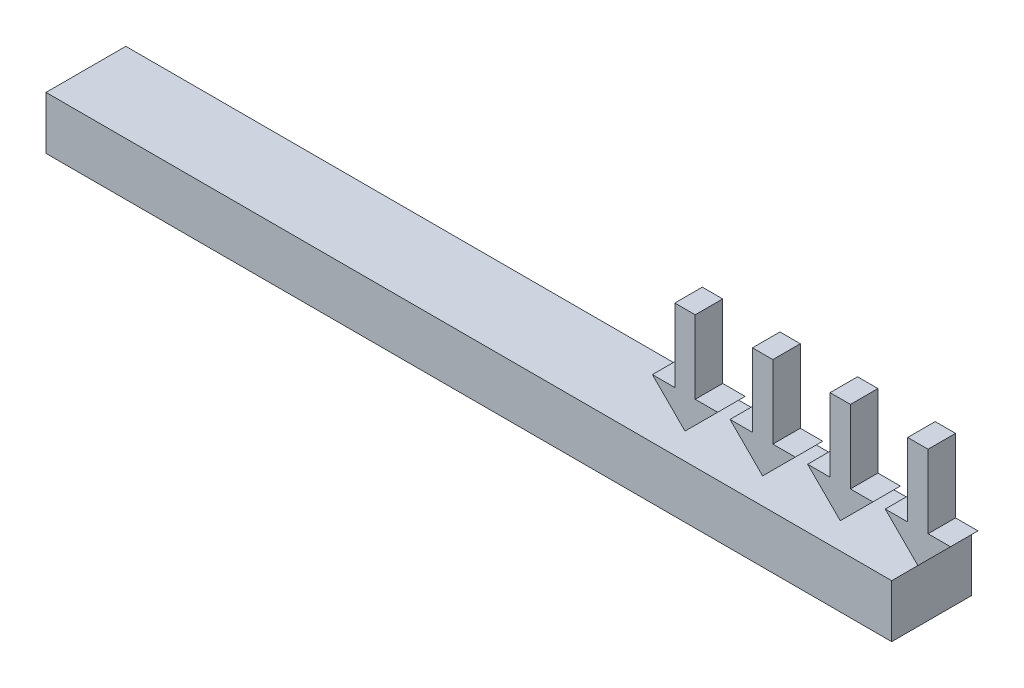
ISO-10303-21;
HEADER;
FILE_DESCRIPTION(('STEP AP214'),'2;1');
FILE_NAME('part.step','',(''),(''),'','','');
FILE_SCHEMA(('AUTOMOTIVE_DESIGN { 1 0 10303 214 1 1 1 1 }'));
ENDSEC;
DATA;
#1=APPLICATION_CONTEXT('core data for automotive mechanical design processes');
#2=APPLICATION_PROTOCOL_DEFINITION('international standard','automotive_design',2000,#1);
#3=PRODUCT_CONTEXT('',#1,'mechanical');
#4=PRODUCT('Part','Part','',(#3));
#5=PRODUCT_RELATED_PRODUCT_CATEGORY('part','',(#4));
#6=PRODUCT_DEFINITION_FORMATION('','',#4);
#7=PRODUCT_DEFINITION_CONTEXT('part definition',#1,'design');
#8=PRODUCT_DEFINITION('design','',#6,#7);
#9=PRODUCT_DEFINITION_SHAPE('','',#8);
#10=(LENGTH_UNIT() NAMED_UNIT(*) SI_UNIT(.MILLI.,.METRE.));
#11=(NAMED_UNIT(*) PLANE_ANGLE_UNIT() SI_UNIT($,.RADIAN.));
#12=(NAMED_UNIT(*) SI_UNIT($,.STERADIAN.) SOLID_ANGLE_UNIT());
#13=UNCERTAINTY_MEASURE_WITH_UNIT(LENGTH_MEASURE(1.E-05),#10,'distance_accuracy_value','');
#14=(GEOMETRIC_REPRESENTATION_CONTEXT(3) GLOBAL_UNCERTAINTY_ASSIGNED_CONTEXT((#13)) GLOBAL_UNIT_ASSIGNED_CONTEXT((#10,
#11,#12)) REPRESENTATION_CONTEXT('',''));
#15=CARTESIAN_POINT('',(0.,0.,0.));
#16=DIRECTION('',(0.,0.,1.));
#17=DIRECTION('',(1.,0.,0.));
#18=AXIS2_PLACEMENT_3D('',#15,#16,#17);
#19=CARTESIAN_POINT('',(289.602018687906,76.2654378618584,6.604));
#20=DIRECTION('',(1.,0.,0.));
#21=DIRECTION('',(0.,0.,-1.));
#22=AXIS2_PLACEMENT_3D('',#19,#20,#21);
#23=PLANE('',#22);
#24=DIRECTION('',(0.,-1.,0.));
#25=VECTOR('',#24,1.);
#26=CARTESIAN_POINT('',(289.602018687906,76.2654378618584,-6.604));
#27=LINE('',#26,#25);
#28=CARTESIAN_POINT('',(289.602018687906,76.2654378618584,-6.604));
#29=VERTEX_POINT('',#28);
#30=CARTESIAN_POINT('',(289.602018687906,41.0825470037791,-6.604));
#31=VERTEX_POINT('',#30);
#32=EDGE_CURVE('E132',#29,#31,#27,.T.);
#33=ORIENTED_EDGE('',*,*,#32,.T.);
#34=DIRECTION('',(0.,0.,-1.));
#35=VECTOR('',#34,1.);
#36=CARTESIAN_POINT('',(289.602018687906,41.0825470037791,6.604));
#37=LINE('',#36,#35);
#38=CARTESIAN_POINT('',(289.602018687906,41.0825470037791,6.604));
#39=VERTEX_POINT('',#38);
#40=EDGE_CURVE('E12',#39,#31,#37,.T.);
#41=ORIENTED_EDGE('',*,*,#40,.F.);
#42=DIRECTION('',(0.,-1.,0.));
#43=VECTOR('',#42,1.);
#44=CARTESIAN_POINT('',(289.602018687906,76.2654378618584,6.604));
#45=LINE('',#44,#43);
#46=CARTESIAN_POINT('',(289.602018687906,76.2654378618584,6.604));
#47=VERTEX_POINT('',#46);
#48=EDGE_CURVE('E144',#47,#39,#45,.T.);
#49=ORIENTED_EDGE('',*,*,#48,.F.);
#50=DIRECTION('',(0.,0.,-1.));
#51=VECTOR('',#50,1.);
#52=CARTESIAN_POINT('',(289.602018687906,76.2654378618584,6.604));
#53=LINE('',#52,#51);
#54=EDGE_CURVE('E128',#47,#29,#53,.T.);
#55=ORIENTED_EDGE('',*,*,#54,.T.);
#56=EDGE_LOOP('',(#33,#41,#49,#55));
#57=FACE_BOUND('',#56,.T.);
#58=ADVANCED_FACE('F42',(#57),#23,.F.);
#59=CARTESIAN_POINT('',(289.602018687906,41.0825470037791,6.604));
#60=DIRECTION('',(0.,-1.,0.));
#61=DIRECTION('',(0.,0.,-1.));
#62=AXIS2_PLACEMENT_3D('',#59,#60,#61);
#63=PLANE('',#62);
#64=DIRECTION('',(-1.,0.,0.));
#65=VECTOR('',#64,1.);
#66=CARTESIAN_POINT('',(289.602018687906,41.0825470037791,-6.604));
#67=LINE('',#66,#65);
#68=CARTESIAN_POINT('',(278.817452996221,41.0825470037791,-6.604));
#69=VERTEX_POINT('',#68);
#70=EDGE_CURVE('E135',#31,#69,#67,.T.);
#71=ORIENTED_EDGE('',*,*,#70,.T.);
#72=DIRECTION('',(0.,0.,-1.));
#73=VECTOR('',#72,1.);
#74=CARTESIAN_POINT('',(278.817452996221,41.0825470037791,6.604));
#75=LINE('',#74,#73);
#76=CARTESIAN_POINT('',(278.817452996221,41.0825470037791,6.604));
#77=VERTEX_POINT('',#76);
#78=EDGE_CURVE('E50',#77,#69,#75,.T.);
#79=ORIENTED_EDGE('',*,*,#78,.F.);
#80=DIRECTION('',(-1.,0.,0.));
#81=VECTOR('',#80,1.);
#82=CARTESIAN_POINT('',(289.602018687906,41.0825470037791,6.604));
#83=LINE('',#82,#81);
#84=EDGE_CURVE('E98',#39,#77,#83,.T.);
#85=ORIENTED_EDGE('',*,*,#84,.F.);
#86=ORIENTED_EDGE('',*,*,#40,.T.);
#87=EDGE_LOOP('',(#71,#79,#85,#86));
#88=FACE_BOUND('',#87,.T.);
#89=ADVANCED_FACE('F169',(#88),#63,.F.);
#90=CARTESIAN_POINT('',(278.817452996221,41.0825470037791,6.604));
#91=DIRECTION('',(0.707106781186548,0.707106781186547,0.));
#92=DIRECTION('',(-0.707106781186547,0.707106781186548,0.));
#93=AXIS2_PLACEMENT_3D('',#90,#91,#92);
#94=PLANE('',#93);
#95=DIRECTION('',(0.707106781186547,-0.707106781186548,0.));
#96=VECTOR('',#95,1.);
#97=CARTESIAN_POINT('',(278.817452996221,41.0825470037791,-6.604));
#98=LINE('',#97,#96);
#99=CARTESIAN_POINT('',(294.5,25.4,-6.604));
#100=VERTEX_POINT('',#99);
#101=EDGE_CURVE('E137',#69,#100,#98,.T.);
#102=ORIENTED_EDGE('',*,*,#101,.T.);
#103=DIRECTION('',(0.,0.,-1.));
#104=VECTOR('',#103,1.);
#105=CARTESIAN_POINT('',(294.5,25.4,6.604));
#106=LINE('',#105,#104);
#107=CARTESIAN_POINT('',(294.5,25.4,6.604));
#108=VERTEX_POINT('',#107);
#109=EDGE_CURVE('E148',#108,#100,#106,.T.);
#110=ORIENTED_EDGE('',*,*,#109,.F.);
#111=DIRECTION('',(0.707106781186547,-0.707106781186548,0.));
#112=VECTOR('',#111,1.);
#113=CARTESIAN_POINT('',(278.817452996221,41.0825470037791,6.604));
#114=LINE('',#113,#112);
#115=EDGE_CURVE('E156',#77,#108,#114,.T.);
#116=ORIENTED_EDGE('',*,*,#115,.F.);
#117=ORIENTED_EDGE('',*,*,#78,.T.);
#118=EDGE_LOOP('',(#102,#110,#116,#117));
#119=FACE_BOUND('',#118,.T.);
#120=ADVANCED_FACE('F154',(#119),#94,.F.);
#121=CARTESIAN_POINT('',(294.5,25.4,6.604));
#122=DIRECTION('',(-0.707106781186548,0.707106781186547,0.));
#123=DIRECTION('',(-0.707106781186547,-0.707106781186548,0.));
#124=AXIS2_PLACEMENT_3D('',#121,#122,#123);
#125=PLANE('',#124);
#126=DIRECTION('',(0.707106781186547,0.707106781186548,0.));
#127=VECTOR('',#126,1.);
#128=CARTESIAN_POINT('',(294.5,25.4,-6.604));
#129=LINE('',#128,#127);
#130=CARTESIAN_POINT('',(310.182547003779,41.0825470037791,-6.604));
#131=VERTEX_POINT('',#130);
#132=EDGE_CURVE('E139',#100,#131,#129,.T.);
#133=ORIENTED_EDGE('',*,*,#132,.T.);
#134=DIRECTION('',(0.,0.,-1.));
#135=VECTOR('',#134,1.);
#136=CARTESIAN_POINT('',(310.182547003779,41.0825470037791,6.604));
#137=LINE('',#136,#135);
#138=CARTESIAN_POINT('',(310.182547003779,41.0825470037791,6.604));
#139=VERTEX_POINT('',#138);
#140=EDGE_CURVE('E123',#139,#131,#137,.T.);
#141=ORIENTED_EDGE('',*,*,#140,.F.);
#142=DIRECTION('',(0.707106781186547,0.707106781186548,0.));
#143=VECTOR('',#142,1.);
#144=CARTESIAN_POINT('',(294.5,25.4,6.604));
#145=LINE('',#144,#143);
#146=EDGE_CURVE('E114',#108,#139,#145,.T.);
#147=ORIENTED_EDGE('',*,*,#146,.F.);
#148=ORIENTED_EDGE('',*,*,#109,.T.);
#149=EDGE_LOOP('',(#133,#141,#147,#148));
#150=FACE_BOUND('',#149,.T.);
#151=ADVANCED_FACE('F162',(#150),#125,.F.);
#152=CARTESIAN_POINT('',(310.182547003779,41.0825470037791,6.604));
#153=DIRECTION('',(0.,-1.,0.));
#154=DIRECTION('',(0.,0.,-1.));
#155=AXIS2_PLACEMENT_3D('',#152,#153,#154);
#156=PLANE('',#155);
#157=DIRECTION('',(-1.,0.,0.));
#158=VECTOR('',#157,1.);
#159=CARTESIAN_POINT('',(310.182547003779,41.0825470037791,-6.604));
#160=LINE('',#159,#158);
#161=CARTESIAN_POINT('',(299.397981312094,41.0825470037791,-6.604));
#162=VERTEX_POINT('',#161);
#163=EDGE_CURVE('E122',#131,#162,#160,.T.);
#164=ORIENTED_EDGE('',*,*,#163,.T.);
#165=DIRECTION('',(0.,0.,-1.));
#166=VECTOR('',#165,1.);
#167=CARTESIAN_POINT('',(299.397981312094,41.0825470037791,6.604));
#168=LINE('',#167,#166);
#169=CARTESIAN_POINT('',(299.397981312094,41.0825470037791,6.604));
#170=VERTEX_POINT('',#169);
#171=EDGE_CURVE('E119',#170,#162,#168,.T.);
#172=ORIENTED_EDGE('',*,*,#171,.F.);
#173=DIRECTION('',(-1.,0.,0.));
#174=VECTOR('',#173,1.);
#175=CARTESIAN_POINT('',(310.182547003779,41.0825470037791,6.604));
#176=LINE('',#175,#174);
#177=EDGE_CURVE('E108',#139,#170,#176,.T.);
#178=ORIENTED_EDGE('',*,*,#177,.F.);
#179=ORIENTED_EDGE('',*,*,#140,.T.);
#180=EDGE_LOOP('',(#164,#172,#178,#179));
#181=FACE_BOUND('',#180,.T.);
#182=ADVANCED_FACE('F120',(#181),#156,.F.);
#183=CARTESIAN_POINT('',(299.397981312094,76.2654378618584,6.604));
#184=DIRECTION('',(-1.,0.,0.));
#185=DIRECTION('',(0.,0.,1.));
#186=AXIS2_PLACEMENT_3D('',#183,#184,#185);
#187=PLANE('',#186);
#188=DIRECTION('',(0.,1.,0.));
#189=VECTOR('',#188,1.);
#190=CARTESIAN_POINT('',(299.397981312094,76.2654378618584,-6.604));
#191=LINE('',#190,#189);
#192=CARTESIAN_POINT('',(299.397981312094,76.2654378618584,-6.604));
#193=VERTEX_POINT('',#192);
#194=EDGE_CURVE('E84',#162,#193,#191,.T.);
#195=ORIENTED_EDGE('',*,*,#194,.T.);
#196=DIRECTION('',(0.,0.,-1.));
#197=VECTOR('',#196,1.);
#198=CARTESIAN_POINT('',(299.397981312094,76.2654378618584,6.604));
#199=LINE('',#198,#197);
#200=CARTESIAN_POINT('',(299.397981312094,76.2654378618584,6.604));
#201=VERTEX_POINT('',#200);
#202=EDGE_CURVE('E124',#201,#193,#199,.T.);
#203=ORIENTED_EDGE('',*,*,#202,.F.);
#204=DIRECTION('',(0.,1.,0.));
#205=VECTOR('',#204,1.);
#206=CARTESIAN_POINT('',(299.397981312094,76.2654378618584,6.604));
#207=LINE('',#206,#205);
#208=EDGE_CURVE('E112',#170,#201,#207,.T.);
#209=ORIENTED_EDGE('',*,*,#208,.F.);
#210=ORIENTED_EDGE('',*,*,#171,.T.);
#211=EDGE_LOOP('',(#195,#203,#209,#210));
#212=FACE_BOUND('',#211,.T.);
#213=ADVANCED_FACE('F126',(#212),#187,.F.);
#214=CARTESIAN_POINT('',(289.602018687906,76.2654378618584,6.604));
#215=DIRECTION('',(0.,-1.,0.));
#216=DIRECTION('',(0.,0.,-1.));
#217=AXIS2_PLACEMENT_3D('',#214,#215,#216);
#218=PLANE('',#217);
#219=DIRECTION('',(-1.,0.,0.));
#220=VECTOR('',#219,1.);
#221=CARTESIAN_POINT('',(289.602018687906,76.2654378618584,-6.604));
#222=LINE('',#221,#220);
#223=EDGE_CURVE('E90',#193,#29,#222,.T.);
#224=ORIENTED_EDGE('',*,*,#223,.T.);
#225=ORIENTED_EDGE('',*,*,#54,.F.);
#226=DIRECTION('',(-1.,0.,0.));
#227=VECTOR('',#226,1.);
#228=CARTESIAN_POINT('',(289.602018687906,76.2654378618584,6.604));
#229=LINE('',#228,#227);
#230=EDGE_CURVE('E58',#201,#47,#229,.T.);
#231=ORIENTED_EDGE('',*,*,#230,.F.);
#232=ORIENTED_EDGE('',*,*,#202,.T.);
#233=EDGE_LOOP('',(#224,#225,#231,#232));
#234=FACE_BOUND('',#233,.T.);
#235=ADVANCED_FACE('F183',(#234),#218,.F.);
#236=CARTESIAN_POINT('',(289.602018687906,41.0825470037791,6.604));
#237=DIRECTION('',(0.,0.,-1.));
#238=DIRECTION('',(-1.,0.,0.));
#239=AXIS2_PLACEMENT_3D('',#236,#237,#238);
#240=PLANE('',#239);
#241=ORIENTED_EDGE('',*,*,#48,.T.);
#242=ORIENTED_EDGE('',*,*,#84,.T.);
#243=ORIENTED_EDGE('',*,*,#115,.T.);
#244=ORIENTED_EDGE('',*,*,#146,.T.);
#245=ORIENTED_EDGE('',*,*,#177,.T.);
#246=ORIENTED_EDGE('',*,*,#208,.T.);
#247=ORIENTED_EDGE('',*,*,#230,.T.);
#248=EDGE_LOOP('',(#241,#242,#243,#244,#245,#246,#247));
#249=FACE_BOUND('',#248,.T.);
#250=ADVANCED_FACE('F110',(#249),#240,.F.);
#251=CARTESIAN_POINT('',(289.602018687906,41.0825470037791,-6.604));
#252=DIRECTION('',(0.,0.,-1.));
#253=DIRECTION('',(-1.,0.,0.));
#254=AXIS2_PLACEMENT_3D('',#251,#252,#253);
#255=PLANE('',#254);
#256=ORIENTED_EDGE('',*,*,#32,.F.);
#257=ORIENTED_EDGE('',*,*,#223,.F.);
#258=ORIENTED_EDGE('',*,*,#194,.F.);
#259=ORIENTED_EDGE('',*,*,#163,.F.);
#260=ORIENTED_EDGE('',*,*,#132,.F.);
#261=ORIENTED_EDGE('',*,*,#101,.F.);
#262=ORIENTED_EDGE('',*,*,#70,.F.);
#263=EDGE_LOOP('',(#256,#257,#258,#259,#260,#261,#262));
#264=FACE_BOUND('',#263,.T.);
#265=ADVANCED_FACE('F160',(#264),#255,.T.);
#266=CLOSED_SHELL('',(#58,#89,#120,#151,#182,#213,#235,#250,#265));
#267=MANIFOLD_SOLID_BREP('B2',#266);
#268=CARTESIAN_POINT('',(326.902018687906,76.2654378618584,6.604));
#269=DIRECTION('',(1.,0.,0.));
#270=DIRECTION('',(0.,0.,-1.));
#271=AXIS2_PLACEMENT_3D('',#268,#269,#270);
#272=PLANE('',#271);
#273=DIRECTION('',(0.,-1.,0.));
#274=VECTOR('',#273,1.);
#275=CARTESIAN_POINT('',(326.902018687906,76.2654378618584,-6.604));
#276=LINE('',#275,#274);
#277=CARTESIAN_POINT('',(326.902018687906,76.2654378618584,-6.604));
#278=VERTEX_POINT('',#277);
#279=CARTESIAN_POINT('',(326.902018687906,41.0825470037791,-6.604));
#280=VERTEX_POINT('',#279);
#281=EDGE_CURVE('E344',#278,#280,#276,.T.);
#282=ORIENTED_EDGE('',*,*,#281,.T.);
#283=DIRECTION('',(0.,0.,-1.));
#284=VECTOR('',#283,1.);
#285=CARTESIAN_POINT('',(326.902018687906,41.0825470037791,6.604));
#286=LINE('',#285,#284);
#287=CARTESIAN_POINT('',(326.902018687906,41.0825470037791,6.604));
#288=VERTEX_POINT('',#287);
#289=EDGE_CURVE('E40',#288,#280,#286,.T.);
#290=ORIENTED_EDGE('',*,*,#289,.F.);
#291=DIRECTION('',(0.,-1.,0.));
#292=VECTOR('',#291,1.);
#293=CARTESIAN_POINT('',(326.902018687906,76.2654378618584,6.604));
#294=LINE('',#293,#292);
#295=CARTESIAN_POINT('',(326.902018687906,76.2654378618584,6.604));
#296=VERTEX_POINT('',#295);
#297=EDGE_CURVE('E356',#296,#288,#294,.T.);
#298=ORIENTED_EDGE('',*,*,#297,.F.);
#299=DIRECTION('',(0.,0.,-1.));
#300=VECTOR('',#299,1.);
#301=CARTESIAN_POINT('',(326.902018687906,76.2654378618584,6.604));
#302=LINE('',#301,#300);
#303=EDGE_CURVE('E340',#296,#278,#302,.T.);
#304=ORIENTED_EDGE('',*,*,#303,.T.);
#305=EDGE_LOOP('',(#282,#290,#298,#304));
#306=FACE_BOUND('',#305,.T.);
#307=ADVANCED_FACE('F254',(#306),#272,.F.);
#308=CARTESIAN_POINT('',(326.902018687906,41.0825470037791,6.604));
#309=DIRECTION('',(0.,-1.,0.));
#310=DIRECTION('',(0.,0.,-1.));
#311=AXIS2_PLACEMENT_3D('',#308,#309,#310);
#312=PLANE('',#311);
#313=DIRECTION('',(-1.,0.,0.));
#314=VECTOR('',#313,1.);
#315=CARTESIAN_POINT('',(326.902018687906,41.0825470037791,-6.604));
#316=LINE('',#315,#314);
#317=CARTESIAN_POINT('',(316.117452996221,41.0825470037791,-6.604));
#318=VERTEX_POINT('',#317);
#319=EDGE_CURVE('E347',#280,#318,#316,.T.);
#320=ORIENTED_EDGE('',*,*,#319,.T.);
#321=DIRECTION('',(0.,0.,-1.));
#322=VECTOR('',#321,1.);
#323=CARTESIAN_POINT('',(316.117452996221,41.0825470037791,6.604));
#324=LINE('',#323,#322);
#325=CARTESIAN_POINT('',(316.117452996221,41.0825470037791,6.604));
#326=VERTEX_POINT('',#325);
#327=EDGE_CURVE('E262',#326,#318,#324,.T.);
#328=ORIENTED_EDGE('',*,*,#327,.F.);
#329=DIRECTION('',(-1.,0.,0.));
#330=VECTOR('',#329,1.);
#331=CARTESIAN_POINT('',(326.902018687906,41.0825470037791,6.604));
#332=LINE('',#331,#330);
#333=EDGE_CURVE('E310',#288,#326,#332,.T.);
#334=ORIENTED_EDGE('',*,*,#333,.F.);
#335=ORIENTED_EDGE('',*,*,#289,.T.);
#336=EDGE_LOOP('',(#320,#328,#334,#335));
#337=FACE_BOUND('',#336,.T.);
#338=ADVANCED_FACE('F381',(#337),#312,.F.);
#339=CARTESIAN_POINT('',(316.117452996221,41.0825470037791,6.604));
#340=DIRECTION('',(0.707106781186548,0.707106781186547,0.));
#341=DIRECTION('',(-0.707106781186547,0.707106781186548,0.));
#342=AXIS2_PLACEMENT_3D('',#339,#340,#341);
#343=PLANE('',#342);
#344=DIRECTION('',(0.707106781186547,-0.707106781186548,0.));
#345=VECTOR('',#344,1.);
#346=CARTESIAN_POINT('',(316.117452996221,41.0825470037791,-6.604));
#347=LINE('',#346,#345);
#348=CARTESIAN_POINT('',(331.8,25.4,-6.604));
#349=VERTEX_POINT('',#348);
#350=EDGE_CURVE('E349',#318,#349,#347,.T.);
#351=ORIENTED_EDGE('',*,*,#350,.T.);
#352=DIRECTION('',(0.,0.,-1.));
#353=VECTOR('',#352,1.);
#354=CARTESIAN_POINT('',(331.8,25.4,6.604));
#355=LINE('',#354,#353);
#356=CARTESIAN_POINT('',(331.8,25.4,6.604));
#357=VERTEX_POINT('',#356);
#358=EDGE_CURVE('E360',#357,#349,#355,.T.);
#359=ORIENTED_EDGE('',*,*,#358,.F.);
#360=DIRECTION('',(0.707106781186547,-0.707106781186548,0.));
#361=VECTOR('',#360,1.);
#362=CARTESIAN_POINT('',(316.117452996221,41.0825470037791,6.604));
#363=LINE('',#362,#361);
#364=EDGE_CURVE('E368',#326,#357,#363,.T.);
#365=ORIENTED_EDGE('',*,*,#364,.F.);
#366=ORIENTED_EDGE('',*,*,#327,.T.);
#367=EDGE_LOOP('',(#351,#359,#365,#366));
#368=FACE_BOUND('',#367,.T.);
#369=ADVANCED_FACE('F366',(#368),#343,.F.);
#370=CARTESIAN_POINT('',(331.8,25.4,6.604));
#371=DIRECTION('',(-0.707106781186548,0.707106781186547,0.));
#372=DIRECTION('',(-0.707106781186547,-0.707106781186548,0.));
#373=AXIS2_PLACEMENT_3D('',#370,#371,#372);
#374=PLANE('',#373);
#375=DIRECTION('',(0.707106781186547,0.707106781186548,0.));
#376=VECTOR('',#375,1.);
#377=CARTESIAN_POINT('',(331.8,25.4,-6.604));
#378=LINE('',#377,#376);
#379=CARTESIAN_POINT('',(347.482547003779,41.0825470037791,-6.604));
#380=VERTEX_POINT('',#379);
#381=EDGE_CURVE('E351',#349,#380,#378,.T.);
#382=ORIENTED_EDGE('',*,*,#381,.T.);
#383=DIRECTION('',(0.,0.,-1.));
#384=VECTOR('',#383,1.);
#385=CARTESIAN_POINT('',(347.482547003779,41.0825470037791,6.604));
#386=LINE('',#385,#384);
#387=CARTESIAN_POINT('',(347.482547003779,41.0825470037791,6.604));
#388=VERTEX_POINT('',#387);
#389=EDGE_CURVE('E335',#388,#380,#386,.T.);
#390=ORIENTED_EDGE('',*,*,#389,.F.);
#391=DIRECTION('',(0.707106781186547,0.707106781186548,0.));
#392=VECTOR('',#391,1.);
#393=CARTESIAN_POINT('',(331.8,25.4,6.604));
#394=LINE('',#393,#392);
#395=EDGE_CURVE('E326',#357,#388,#394,.T.);
#396=ORIENTED_EDGE('',*,*,#395,.F.);
#397=ORIENTED_EDGE('',*,*,#358,.T.);
#398=EDGE_LOOP('',(#382,#390,#396,#397));
#399=FACE_BOUND('',#398,.T.);
#400=ADVANCED_FACE('F374',(#399),#374,.F.);
#401=CARTESIAN_POINT('',(347.482547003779,41.0825470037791,6.604));
#402=DIRECTION('',(0.,-1.,0.));
#403=DIRECTION('',(0.,0.,-1.));
#404=AXIS2_PLACEMENT_3D('',#401,#402,#403);
#405=PLANE('',#404);
#406=DIRECTION('',(-1.,0.,0.));
#407=VECTOR('',#406,1.);
#408=CARTESIAN_POINT('',(347.482547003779,41.0825470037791,-6.604));
#409=LINE('',#408,#407);
#410=CARTESIAN_POINT('',(336.697981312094,41.0825470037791,-6.604));
#411=VERTEX_POINT('',#410);
#412=EDGE_CURVE('E334',#380,#411,#409,.T.);
#413=ORIENTED_EDGE('',*,*,#412,.T.);
#414=DIRECTION('',(0.,0.,-1.));
#415=VECTOR('',#414,1.);
#416=CARTESIAN_POINT('',(336.697981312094,41.0825470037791,6.604));
#417=LINE('',#416,#415);
#418=CARTESIAN_POINT('',(336.697981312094,41.0825470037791,6.604));
#419=VERTEX_POINT('',#418);
#420=EDGE_CURVE('E331',#419,#411,#417,.T.);
#421=ORIENTED_EDGE('',*,*,#420,.F.);
#422=DIRECTION('',(-1.,0.,0.));
#423=VECTOR('',#422,1.);
#424=CARTESIAN_POINT('',(347.482547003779,41.0825470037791,6.604));
#425=LINE('',#424,#423);
#426=EDGE_CURVE('E320',#388,#419,#425,.T.);
#427=ORIENTED_EDGE('',*,*,#426,.F.);
#428=ORIENTED_EDGE('',*,*,#389,.T.);
#429=EDGE_LOOP('',(#413,#421,#427,#428));
#430=FACE_BOUND('',#429,.T.);
#431=ADVANCED_FACE('F332',(#430),#405,.F.);
#432=CARTESIAN_POINT('',(336.697981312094,76.2654378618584,6.604));
#433=DIRECTION('',(-1.,0.,0.));
#434=DIRECTION('',(0.,0.,1.));
#435=AXIS2_PLACEMENT_3D('',#432,#433,#434);
#436=PLANE('',#435);
#437=DIRECTION('',(0.,1.,0.));
#438=VECTOR('',#437,1.);
#439=CARTESIAN_POINT('',(336.697981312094,76.2654378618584,-6.604));
#440=LINE('',#439,#438);
#441=CARTESIAN_POINT('',(336.697981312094,76.2654378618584,-6.604));
#442=VERTEX_POINT('',#441);
#443=EDGE_CURVE('E296',#411,#442,#440,.T.);
#444=ORIENTED_EDGE('',*,*,#443,.T.);
#445=DIRECTION('',(0.,0.,-1.));
#446=VECTOR('',#445,1.);
#447=CARTESIAN_POINT('',(336.697981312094,76.2654378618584,6.604));
#448=LINE('',#447,#446);
#449=CARTESIAN_POINT('',(336.697981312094,76.2654378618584,6.604));
#450=VERTEX_POINT('',#449);
#451=EDGE_CURVE('E336',#450,#442,#448,.T.);
#452=ORIENTED_EDGE('',*,*,#451,.F.);
#453=DIRECTION('',(0.,1.,0.));
#454=VECTOR('',#453,1.);
#455=CARTESIAN_POINT('',(336.697981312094,76.2654378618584,6.604));
#456=LINE('',#455,#454);
#457=EDGE_CURVE('E324',#419,#450,#456,.T.);
#458=ORIENTED_EDGE('',*,*,#457,.F.);
#459=ORIENTED_EDGE('',*,*,#420,.T.);
#460=EDGE_LOOP('',(#444,#452,#458,#459));
#461=FACE_BOUND('',#460,.T.);
#462=ADVANCED_FACE('F338',(#461),#436,.F.);
#463=CARTESIAN_POINT('',(326.902018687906,76.2654378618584,6.604));
#464=DIRECTION('',(0.,-1.,0.));
#465=DIRECTION('',(0.,0.,-1.));
#466=AXIS2_PLACEMENT_3D('',#463,#464,#465);
#467=PLANE('',#466);
#468=DIRECTION('',(-1.,0.,0.));
#469=VECTOR('',#468,1.);
#470=CARTESIAN_POINT('',(326.902018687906,76.2654378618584,-6.604));
#471=LINE('',#470,#469);
#472=EDGE_CURVE('E302',#442,#278,#471,.T.);
#473=ORIENTED_EDGE('',*,*,#472,.T.);
#474=ORIENTED_EDGE('',*,*,#303,.F.);
#475=DIRECTION('',(-1.,0.,0.));
#476=VECTOR('',#475,1.);
#477=CARTESIAN_POINT('',(326.902018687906,76.2654378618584,6.604));
#478=LINE('',#477,#476);
#479=EDGE_CURVE('E270',#450,#296,#478,.T.);
#480=ORIENTED_EDGE('',*,*,#479,.F.);
#481=ORIENTED_EDGE('',*,*,#451,.T.);
#482=EDGE_LOOP('',(#473,#474,#480,#481));
#483=FACE_BOUND('',#482,.T.);
#484=ADVANCED_FACE('F395',(#483),#467,.F.);
#485=CARTESIAN_POINT('',(326.902018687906,41.0825470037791,6.604));
#486=DIRECTION('',(0.,0.,-1.));
#487=DIRECTION('',(-1.,0.,0.));
#488=AXIS2_PLACEMENT_3D('',#485,#486,#487);
#489=PLANE('',#488);
#490=ORIENTED_EDGE('',*,*,#297,.T.);
#491=ORIENTED_EDGE('',*,*,#333,.T.);
#492=ORIENTED_EDGE('',*,*,#364,.T.);
#493=ORIENTED_EDGE('',*,*,#395,.T.);
#494=ORIENTED_EDGE('',*,*,#426,.T.);
#495=ORIENTED_EDGE('',*,*,#457,.T.);
#496=ORIENTED_EDGE('',*,*,#479,.T.);
#497=EDGE_LOOP('',(#490,#491,#492,#493,#494,#495,#496));
#498=FACE_BOUND('',#497,.T.);
#499=ADVANCED_FACE('F322',(#498),#489,.F.);
#500=CARTESIAN_POINT('',(326.902018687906,41.0825470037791,-6.604));
#501=DIRECTION('',(0.,0.,-1.));
#502=DIRECTION('',(-1.,0.,0.));
#503=AXIS2_PLACEMENT_3D('',#500,#501,#502);
#504=PLANE('',#503);
#505=ORIENTED_EDGE('',*,*,#281,.F.);
#506=ORIENTED_EDGE('',*,*,#472,.F.);
#507=ORIENTED_EDGE('',*,*,#443,.F.);
#508=ORIENTED_EDGE('',*,*,#412,.F.);
#509=ORIENTED_EDGE('',*,*,#381,.F.);
#510=ORIENTED_EDGE('',*,*,#350,.F.);
#511=ORIENTED_EDGE('',*,*,#319,.F.);
#512=EDGE_LOOP('',(#505,#506,#507,#508,#509,#510,#511));
#513=FACE_BOUND('',#512,.T.);
#514=ADVANCED_FACE('F372',(#513),#504,.T.);
#515=CLOSED_SHELL('',(#307,#338,#369,#400,#431,#462,#484,#499,#514));
#516=MANIFOLD_SOLID_BREP('B6',#515);
#517=CARTESIAN_POINT('',(364.202018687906,76.2654378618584,6.604));
#518=DIRECTION('',(1.,0.,0.));
#519=DIRECTION('',(0.,0.,-1.));
#520=AXIS2_PLACEMENT_3D('',#517,#518,#519);
#521=PLANE('',#520);
#522=DIRECTION('',(0.,-1.,0.));
#523=VECTOR('',#522,1.);
#524=CARTESIAN_POINT('',(364.202018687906,76.2654378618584,-6.604));
#525=LINE('',#524,#523);
#526=CARTESIAN_POINT('',(364.202018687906,76.2654378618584,-6.604));
#527=VERTEX_POINT('',#526);
#528=CARTESIAN_POINT('',(364.202018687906,41.0825470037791,-6.604));
#529=VERTEX_POINT('',#528);
#530=EDGE_CURVE('E556',#527,#529,#525,.T.);
#531=ORIENTED_EDGE('',*,*,#530,.T.);
#532=DIRECTION('',(0.,0.,-1.));
#533=VECTOR('',#532,1.);
#534=CARTESIAN_POINT('',(364.202018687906,41.0825470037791,6.604));
#535=LINE('',#534,#533);
#536=CARTESIAN_POINT('',(364.202018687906,41.0825470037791,6.604));
#537=VERTEX_POINT('',#536);
#538=EDGE_CURVE('E252',#537,#529,#535,.T.);
#539=ORIENTED_EDGE('',*,*,#538,.F.);
#540=DIRECTION('',(0.,-1.,0.));
#541=VECTOR('',#540,1.);
#542=CARTESIAN_POINT('',(364.202018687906,76.2654378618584,6.604));
#543=LINE('',#542,#541);
#544=CARTESIAN_POINT('',(364.202018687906,76.2654378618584,6.604));
#545=VERTEX_POINT('',#544);
#546=EDGE_CURVE('E568',#545,#537,#543,.T.);
#547=ORIENTED_EDGE('',*,*,#546,.F.);
#548=DIRECTION('',(0.,0.,-1.));
#549=VECTOR('',#548,1.);
#550=CARTESIAN_POINT('',(364.202018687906,76.2654378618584,6.604));
#551=LINE('',#550,#549);
#552=EDGE_CURVE('E552',#545,#527,#551,.T.);
#553=ORIENTED_EDGE('',*,*,#552,.T.);
#554=EDGE_LOOP('',(#531,#539,#547,#553));
#555=FACE_BOUND('',#554,.T.);
#556=ADVANCED_FACE('F466',(#555),#521,.F.);
#557=CARTESIAN_POINT('',(364.202018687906,41.0825470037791,6.604));
#558=DIRECTION('',(0.,-1.,0.));
#559=DIRECTION('',(0.,0.,-1.));
#560=AXIS2_PLACEMENT_3D('',#557,#558,#559);
#561=PLANE('',#560);
#562=DIRECTION('',(-1.,0.,0.));
#563=VECTOR('',#562,1.);
#564=CARTESIAN_POINT('',(364.202018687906,41.0825470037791,-6.604));
#565=LINE('',#564,#563);
#566=CARTESIAN_POINT('',(353.417452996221,41.0825470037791,-6.604));
#567=VERTEX_POINT('',#566);
#568=EDGE_CURVE('E559',#529,#567,#565,.T.);
#569=ORIENTED_EDGE('',*,*,#568,.T.);
#570=DIRECTION('',(0.,0.,-1.));
#571=VECTOR('',#570,1.);
#572=CARTESIAN_POINT('',(353.417452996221,41.0825470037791,6.604));
#573=LINE('',#572,#571);
#574=CARTESIAN_POINT('',(353.417452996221,41.0825470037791,6.604));
#575=VERTEX_POINT('',#574);
#576=EDGE_CURVE('E474',#575,#567,#573,.T.);
#577=ORIENTED_EDGE('',*,*,#576,.F.);
#578=DIRECTION('',(-1.,0.,0.));
#579=VECTOR('',#578,1.);
#580=CARTESIAN_POINT('',(364.202018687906,41.0825470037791,6.604));
#581=LINE('',#580,#579);
#582=EDGE_CURVE('E522',#537,#575,#581,.T.);
#583=ORIENTED_EDGE('',*,*,#582,.F.);
#584=ORIENTED_EDGE('',*,*,#538,.T.);
#585=EDGE_LOOP('',(#569,#577,#583,#584));
#586=FACE_BOUND('',#585,.T.);
#587=ADVANCED_FACE('F593',(#586),#561,.F.);
#588=CARTESIAN_POINT('',(353.417452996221,41.0825470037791,6.604));
#589=DIRECTION('',(0.707106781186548,0.707106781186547,0.));
#590=DIRECTION('',(-0.707106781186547,0.707106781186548,0.));
#591=AXIS2_PLACEMENT_3D('',#588,#589,#590);
#592=PLANE('',#591);
#593=DIRECTION('',(0.707106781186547,-0.707106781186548,0.));
#594=VECTOR('',#593,1.);
#595=CARTESIAN_POINT('',(353.417452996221,41.0825470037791,-6.604));
#596=LINE('',#595,#594);
#597=CARTESIAN_POINT('',(369.1,25.4,-6.604));
#598=VERTEX_POINT('',#597);
#599=EDGE_CURVE('E561',#567,#598,#596,.T.);
#600=ORIENTED_EDGE('',*,*,#599,.T.);
#601=DIRECTION('',(0.,0.,-1.));
#602=VECTOR('',#601,1.);
#603=CARTESIAN_POINT('',(369.1,25.4,6.604));
#604=LINE('',#603,#602);
#605=CARTESIAN_POINT('',(369.1,25.4,6.604));
#606=VERTEX_POINT('',#605);
#607=EDGE_CURVE('E572',#606,#598,#604,.T.);
#608=ORIENTED_EDGE('',*,*,#607,.F.);
#609=DIRECTION('',(0.707106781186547,-0.707106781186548,0.));
#610=VECTOR('',#609,1.);
#611=CARTESIAN_POINT('',(353.417452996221,41.0825470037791,6.604));
#612=LINE('',#611,#610);
#613=EDGE_CURVE('E580',#575,#606,#612,.T.);
#614=ORIENTED_EDGE('',*,*,#613,.F.);
#615=ORIENTED_EDGE('',*,*,#576,.T.);
#616=EDGE_LOOP('',(#600,#608,#614,#615));
#617=FACE_BOUND('',#616,.T.);
#618=ADVANCED_FACE('F578',(#617),#592,.F.);
#619=CARTESIAN_POINT('',(369.1,25.4,6.604));
#620=DIRECTION('',(-0.707106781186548,0.707106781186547,0.));
#621=DIRECTION('',(-0.707106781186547,-0.707106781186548,0.));
#622=AXIS2_PLACEMENT_3D('',#619,#620,#621);
#623=PLANE('',#622);
#624=DIRECTION('',(0.707106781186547,0.707106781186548,0.));
#625=VECTOR('',#624,1.);
#626=CARTESIAN_POINT('',(369.1,25.4,-6.604));
#627=LINE('',#626,#625);
#628=CARTESIAN_POINT('',(384.782547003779,41.0825470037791,-6.604));
#629=VERTEX_POINT('',#628);
#630=EDGE_CURVE('E563',#598,#629,#627,.T.);
#631=ORIENTED_EDGE('',*,*,#630,.T.);
#632=DIRECTION('',(0.,0.,-1.));
#633=VECTOR('',#632,1.);
#634=CARTESIAN_POINT('',(384.782547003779,41.0825470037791,6.604));
#635=LINE('',#634,#633);
#636=CARTESIAN_POINT('',(384.782547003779,41.0825470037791,6.604));
#637=VERTEX_POINT('',#636);
#638=EDGE_CURVE('E547',#637,#629,#635,.T.);
#639=ORIENTED_EDGE('',*,*,#638,.F.);
#640=DIRECTION('',(0.707106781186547,0.707106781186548,0.));
#641=VECTOR('',#640,1.);
#642=CARTESIAN_POINT('',(369.1,25.4,6.604));
#643=LINE('',#642,#641);
#644=EDGE_CURVE('E538',#606,#637,#643,.T.);
#645=ORIENTED_EDGE('',*,*,#644,.F.);
#646=ORIENTED_EDGE('',*,*,#607,.T.);
#647=EDGE_LOOP('',(#631,#639,#645,#646));
#648=FACE_BOUND('',#647,.T.);
#649=ADVANCED_FACE('F586',(#648),#623,.F.);
#650=CARTESIAN_POINT('',(384.782547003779,41.0825470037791,6.604));
#651=DIRECTION('',(0.,-1.,0.));
#652=DIRECTION('',(0.,0.,-1.));
#653=AXIS2_PLACEMENT_3D('',#650,#651,#652);
#654=PLANE('',#653);
#655=DIRECTION('',(-1.,0.,0.));
#656=VECTOR('',#655,1.);
#657=CARTESIAN_POINT('',(384.782547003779,41.0825470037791,-6.604));
#658=LINE('',#657,#656);
#659=CARTESIAN_POINT('',(373.997981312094,41.0825470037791,-6.604));
#660=VERTEX_POINT('',#659);
#661=EDGE_CURVE('E546',#629,#660,#658,.T.);
#662=ORIENTED_EDGE('',*,*,#661,.T.);
#663=DIRECTION('',(0.,0.,-1.));
#664=VECTOR('',#663,1.);
#665=CARTESIAN_POINT('',(373.997981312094,41.0825470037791,6.604));
#666=LINE('',#665,#664);
#667=CARTESIAN_POINT('',(373.997981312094,41.0825470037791,6.604));
#668=VERTEX_POINT('',#667);
#669=EDGE_CURVE('E543',#668,#660,#666,.T.);
#670=ORIENTED_EDGE('',*,*,#669,.F.);
#671=DIRECTION('',(-1.,0.,0.));
#672=VECTOR('',#671,1.);
#673=CARTESIAN_POINT('',(384.782547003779,41.0825470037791,6.604));
#674=LINE('',#673,#672);
#675=EDGE_CURVE('E532',#637,#668,#674,.T.);
#676=ORIENTED_EDGE('',*,*,#675,.F.);
#677=ORIENTED_EDGE('',*,*,#638,.T.);
#678=EDGE_LOOP('',(#662,#670,#676,#677));
#679=FACE_BOUND('',#678,.T.);
#680=ADVANCED_FACE('F544',(#679),#654,.F.);
#681=CARTESIAN_POINT('',(373.997981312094,76.2654378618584,6.604));
#682=DIRECTION('',(-1.,0.,0.));
#683=DIRECTION('',(0.,0.,1.));
#684=AXIS2_PLACEMENT_3D('',#681,#682,#683);
#685=PLANE('',#684);
#686=DIRECTION('',(0.,1.,0.));
#687=VECTOR('',#686,1.);
#688=CARTESIAN_POINT('',(373.997981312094,76.2654378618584,-6.604));
#689=LINE('',#688,#687);
#690=CARTESIAN_POINT('',(373.997981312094,76.2654378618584,-6.604));
#691=VERTEX_POINT('',#690);
#692=EDGE_CURVE('E508',#660,#691,#689,.T.);
#693=ORIENTED_EDGE('',*,*,#692,.T.);
#694=DIRECTION('',(0.,0.,-1.));
#695=VECTOR('',#694,1.);
#696=CARTESIAN_POINT('',(373.997981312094,76.2654378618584,6.604));
#697=LINE('',#696,#695);
#698=CARTESIAN_POINT('',(373.997981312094,76.2654378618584,6.604));
#699=VERTEX_POINT('',#698);
#700=EDGE_CURVE('E548',#699,#691,#697,.T.);
#701=ORIENTED_EDGE('',*,*,#700,.F.);
#702=DIRECTION('',(0.,1.,0.));
#703=VECTOR('',#702,1.);
#704=CARTESIAN_POINT('',(373.997981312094,76.2654378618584,6.604));
#705=LINE('',#704,#703);
#706=EDGE_CURVE('E536',#668,#699,#705,.T.);
#707=ORIENTED_EDGE('',*,*,#706,.F.);
#708=ORIENTED_EDGE('',*,*,#669,.T.);
#709=EDGE_LOOP('',(#693,#701,#707,#708));
#710=FACE_BOUND('',#709,.T.);
#711=ADVANCED_FACE('F550',(#710),#685,.F.);
#712=CARTESIAN_POINT('',(364.202018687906,76.2654378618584,6.604));
#713=DIRECTION('',(0.,-1.,0.));
#714=DIRECTION('',(0.,0.,-1.));
#715=AXIS2_PLACEMENT_3D('',#712,#713,#714);
#716=PLANE('',#715);
#717=DIRECTION('',(-1.,0.,0.));
#718=VECTOR('',#717,1.);
#719=CARTESIAN_POINT('',(364.202018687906,76.2654378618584,-6.604));
#720=LINE('',#719,#718);
#721=EDGE_CURVE('E514',#691,#527,#720,.T.);
#722=ORIENTED_EDGE('',*,*,#721,.T.);
#723=ORIENTED_EDGE('',*,*,#552,.F.);
#724=DIRECTION('',(-1.,0.,0.));
#725=VECTOR('',#724,1.);
#726=CARTESIAN_POINT('',(364.202018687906,76.2654378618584,6.604));
#727=LINE('',#726,#725);
#728=EDGE_CURVE('E482',#699,#545,#727,.T.);
#729=ORIENTED_EDGE('',*,*,#728,.F.);
#730=ORIENTED_EDGE('',*,*,#700,.T.);
#731=EDGE_LOOP('',(#722,#723,#729,#730));
#732=FACE_BOUND('',#731,.T.);
#733=ADVANCED_FACE('F607',(#732),#716,.F.);
#734=CARTESIAN_POINT('',(364.202018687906,41.0825470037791,6.604));
#735=DIRECTION('',(0.,0.,-1.));
#736=DIRECTION('',(-1.,0.,0.));
#737=AXIS2_PLACEMENT_3D('',#734,#735,#736);
#738=PLANE('',#737);
#739=ORIENTED_EDGE('',*,*,#546,.T.);
#740=ORIENTED_EDGE('',*,*,#582,.T.);
#741=ORIENTED_EDGE('',*,*,#613,.T.);
#742=ORIENTED_EDGE('',*,*,#644,.T.);
#743=ORIENTED_EDGE('',*,*,#675,.T.);
#744=ORIENTED_EDGE('',*,*,#706,.T.);
#745=ORIENTED_EDGE('',*,*,#728,.T.);
#746=EDGE_LOOP('',(#739,#740,#741,#742,#743,#744,#745));
#747=FACE_BOUND('',#746,.T.);
#748=ADVANCED_FACE('F534',(#747),#738,.F.);
#749=CARTESIAN_POINT('',(364.202018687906,41.0825470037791,-6.604));
#750=DIRECTION('',(0.,0.,-1.));
#751=DIRECTION('',(-1.,0.,0.));
#752=AXIS2_PLACEMENT_3D('',#749,#750,#751);
#753=PLANE('',#752);
#754=ORIENTED_EDGE('',*,*,#530,.F.);
#755=ORIENTED_EDGE('',*,*,#721,.F.);
#756=ORIENTED_EDGE('',*,*,#692,.F.);
#757=ORIENTED_EDGE('',*,*,#661,.F.);
#758=ORIENTED_EDGE('',*,*,#630,.F.);
#759=ORIENTED_EDGE('',*,*,#599,.F.);
#760=ORIENTED_EDGE('',*,*,#568,.F.);
#761=EDGE_LOOP('',(#754,#755,#756,#757,#758,#759,#760));
#762=FACE_BOUND('',#761,.T.);
#763=ADVANCED_FACE('F584',(#762),#753,.T.);
#764=CLOSED_SHELL('',(#556,#587,#618,#649,#680,#711,#733,#748,#763));
#765=MANIFOLD_SOLID_BREP('B34',#764);
#766=CARTESIAN_POINT('',(401.502018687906,76.2654378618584,6.604));
#767=DIRECTION('',(1.,0.,0.));
#768=DIRECTION('',(0.,0.,-1.));
#769=AXIS2_PLACEMENT_3D('',#766,#767,#768);
#770=PLANE('',#769);
#771=DIRECTION('',(0.,-1.,0.));
#772=VECTOR('',#771,1.);
#773=CARTESIAN_POINT('',(401.502018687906,76.2654378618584,-6.604));
#774=LINE('',#773,#772);
#775=CARTESIAN_POINT('',(401.502018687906,76.2654378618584,-6.604));
#776=VERTEX_POINT('',#775);
#777=CARTESIAN_POINT('',(401.502018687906,41.0825470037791,-6.604));
#778=VERTEX_POINT('',#777);
#779=EDGE_CURVE('E767',#776,#778,#774,.T.);
#780=ORIENTED_EDGE('',*,*,#779,.T.);
#781=DIRECTION('',(0.,0.,-1.));
#782=VECTOR('',#781,1.);
#783=CARTESIAN_POINT('',(401.502018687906,41.0825470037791,6.604));
#784=LINE('',#783,#782);
#785=CARTESIAN_POINT('',(401.502018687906,41.0825470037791,6.604));
#786=VERTEX_POINT('',#785);
#787=EDGE_CURVE('E464',#786,#778,#784,.T.);
#788=ORIENTED_EDGE('',*,*,#787,.F.);
#789=DIRECTION('',(0.,-1.,0.));
#790=VECTOR('',#789,1.);
#791=CARTESIAN_POINT('',(401.502018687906,76.2654378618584,6.604));
#792=LINE('',#791,#790);
#793=CARTESIAN_POINT('',(401.502018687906,76.2654378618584,6.604));
#794=VERTEX_POINT('',#793);
#795=EDGE_CURVE('E779',#794,#786,#792,.T.);
#796=ORIENTED_EDGE('',*,*,#795,.F.);
#797=DIRECTION('',(0.,0.,-1.));
#798=VECTOR('',#797,1.);
#799=CARTESIAN_POINT('',(401.502018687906,76.2654378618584,6.604));
#800=LINE('',#799,#798);
#801=EDGE_CURVE('E763',#794,#776,#800,.T.);
#802=ORIENTED_EDGE('',*,*,#801,.T.);
#803=EDGE_LOOP('',(#780,#788,#796,#802));
#804=FACE_BOUND('',#803,.T.);
#805=ADVANCED_FACE('F677',(#804),#770,.F.);
#806=CARTESIAN_POINT('',(401.502018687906,41.0825470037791,6.604));
#807=DIRECTION('',(0.,-1.,0.));
#808=DIRECTION('',(0.,0.,-1.));
#809=AXIS2_PLACEMENT_3D('',#806,#807,#808);
#810=PLANE('',#809);
#811=DIRECTION('',(-1.,0.,0.));
#812=VECTOR('',#811,1.);
#813=CARTESIAN_POINT('',(401.502018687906,41.0825470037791,-6.604));
#814=LINE('',#813,#812);
#815=CARTESIAN_POINT('',(390.717452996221,41.0825470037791,-6.604));
#816=VERTEX_POINT('',#815);
#817=EDGE_CURVE('E770',#778,#816,#814,.T.);
#818=ORIENTED_EDGE('',*,*,#817,.T.);
#819=DIRECTION('',(0.,0.,-1.));
#820=VECTOR('',#819,1.);
#821=CARTESIAN_POINT('',(390.717452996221,41.0825470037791,6.604));
#822=LINE('',#821,#820);
#823=CARTESIAN_POINT('',(390.717452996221,41.0825470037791,6.604));
#824=VERTEX_POINT('',#823);
#825=EDGE_CURVE('E685',#824,#816,#822,.T.);
#826=ORIENTED_EDGE('',*,*,#825,.F.);
#827=DIRECTION('',(-1.,0.,0.));
#828=VECTOR('',#827,1.);
#829=CARTESIAN_POINT('',(401.502018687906,41.0825470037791,6.604));
#830=LINE('',#829,#828);
#831=EDGE_CURVE('E733',#786,#824,#830,.T.);
#832=ORIENTED_EDGE('',*,*,#831,.F.);
#833=ORIENTED_EDGE('',*,*,#787,.T.);
#834=EDGE_LOOP('',(#818,#826,#832,#833));
#835=FACE_BOUND('',#834,.T.);
#836=ADVANCED_FACE('F804',(#835),#810,.F.);
#837=CARTESIAN_POINT('',(390.717452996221,41.0825470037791,6.604));
#838=DIRECTION('',(0.707106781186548,0.707106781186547,0.));
#839=DIRECTION('',(-0.707106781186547,0.707106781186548,0.));
#840=AXIS2_PLACEMENT_3D('',#837,#838,#839);
#841=PLANE('',#840);
#842=DIRECTION('',(0.707106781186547,-0.707106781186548,0.));
#843=VECTOR('',#842,1.);
#844=CARTESIAN_POINT('',(390.717452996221,41.0825470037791,-6.604));
#845=LINE('',#844,#843);
#846=CARTESIAN_POINT('',(406.4,25.4,-6.604));
#847=VERTEX_POINT('',#846);
#848=EDGE_CURVE('E772',#816,#847,#845,.T.);
#849=ORIENTED_EDGE('',*,*,#848,.T.);
#850=DIRECTION('',(0.,0.,-1.));
#851=VECTOR('',#850,1.);
#852=CARTESIAN_POINT('',(406.4,25.4,6.604));
#853=LINE('',#852,#851);
#854=CARTESIAN_POINT('',(406.4,25.4,6.604));
#855=VERTEX_POINT('',#854);
#856=EDGE_CURVE('E783',#855,#847,#853,.T.);
#857=ORIENTED_EDGE('',*,*,#856,.F.);
#858=DIRECTION('',(0.707106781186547,-0.707106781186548,0.));
#859=VECTOR('',#858,1.);
#860=CARTESIAN_POINT('',(390.717452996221,41.0825470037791,6.604));
#861=LINE('',#860,#859);
#862=EDGE_CURVE('E791',#824,#855,#861,.T.);
#863=ORIENTED_EDGE('',*,*,#862,.F.);
#864=ORIENTED_EDGE('',*,*,#825,.T.);
#865=EDGE_LOOP('',(#849,#857,#863,#864));
#866=FACE_BOUND('',#865,.T.);
#867=ADVANCED_FACE('F789',(#866),#841,.F.);
#868=CARTESIAN_POINT('',(406.4,25.4,6.604));
#869=DIRECTION('',(-0.707106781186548,0.707106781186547,0.));
#870=DIRECTION('',(-0.707106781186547,-0.707106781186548,0.));
#871=AXIS2_PLACEMENT_3D('',#868,#869,#870);
#872=PLANE('',#871);
#873=DIRECTION('',(0.707106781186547,0.707106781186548,0.));
#874=VECTOR('',#873,1.);
#875=CARTESIAN_POINT('',(406.4,25.4,-6.604));
#876=LINE('',#875,#874);
#877=CARTESIAN_POINT('',(422.082547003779,41.0825470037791,-6.604));
#878=VERTEX_POINT('',#877);
#879=EDGE_CURVE('E774',#847,#878,#876,.T.);
#880=ORIENTED_EDGE('',*,*,#879,.T.);
#881=DIRECTION('',(0.,0.,-1.));
#882=VECTOR('',#881,1.);
#883=CARTESIAN_POINT('',(422.082547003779,41.0825470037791,6.604));
#884=LINE('',#883,#882);
#885=CARTESIAN_POINT('',(422.082547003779,41.0825470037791,6.604));
#886=VERTEX_POINT('',#885);
#887=EDGE_CURVE('E758',#886,#878,#884,.T.);
#888=ORIENTED_EDGE('',*,*,#887,.F.);
#889=DIRECTION('',(0.707106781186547,0.707106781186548,0.));
#890=VECTOR('',#889,1.);
#891=CARTESIAN_POINT('',(406.4,25.4,6.604));
#892=LINE('',#891,#890);
#893=EDGE_CURVE('E749',#855,#886,#892,.T.);
#894=ORIENTED_EDGE('',*,*,#893,.F.);
#895=ORIENTED_EDGE('',*,*,#856,.T.);
#896=EDGE_LOOP('',(#880,#888,#894,#895));
#897=FACE_BOUND('',#896,.T.);
#898=ADVANCED_FACE('F797',(#897),#872,.F.);
#899=CARTESIAN_POINT('',(422.082547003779,41.0825470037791,6.604));
#900=DIRECTION('',(0.,-1.,0.));
#901=DIRECTION('',(0.,0.,-1.));
#902=AXIS2_PLACEMENT_3D('',#899,#900,#901);
#903=PLANE('',#902);
#904=DIRECTION('',(-1.,0.,0.));
#905=VECTOR('',#904,1.);
#906=CARTESIAN_POINT('',(422.082547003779,41.0825470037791,-6.604));
#907=LINE('',#906,#905);
#908=CARTESIAN_POINT('',(411.297981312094,41.0825470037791,-6.604));
#909=VERTEX_POINT('',#908);
#910=EDGE_CURVE('E757',#878,#909,#907,.T.);
#911=ORIENTED_EDGE('',*,*,#910,.T.);
#912=DIRECTION('',(0.,0.,-1.));
#913=VECTOR('',#912,1.);
#914=CARTESIAN_POINT('',(411.297981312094,41.0825470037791,6.604));
#915=LINE('',#914,#913);
#916=CARTESIAN_POINT('',(411.297981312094,41.0825470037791,6.604));
#917=VERTEX_POINT('',#916);
#918=EDGE_CURVE('E754',#917,#909,#915,.T.);
#919=ORIENTED_EDGE('',*,*,#918,.F.);
#920=DIRECTION('',(-1.,0.,0.));
#921=VECTOR('',#920,1.);
#922=CARTESIAN_POINT('',(422.082547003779,41.0825470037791,6.604));
#923=LINE('',#922,#921);
#924=EDGE_CURVE('E743',#886,#917,#923,.T.);
#925=ORIENTED_EDGE('',*,*,#924,.F.);
#926=ORIENTED_EDGE('',*,*,#887,.T.);
#927=EDGE_LOOP('',(#911,#919,#925,#926));
#928=FACE_BOUND('',#927,.T.);
#929=ADVANCED_FACE('F755',(#928),#903,.F.);
#930=CARTESIAN_POINT('',(411.297981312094,76.2654378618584,6.604));
#931=DIRECTION('',(-1.,0.,0.));
#932=DIRECTION('',(0.,0.,1.));
#933=AXIS2_PLACEMENT_3D('',#930,#931,#932);
#934=PLANE('',#933);
#935=DIRECTION('',(0.,1.,0.));
#936=VECTOR('',#935,1.);
#937=CARTESIAN_POINT('',(411.297981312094,76.2654378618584,-6.604));
#938=LINE('',#937,#936);
#939=CARTESIAN_POINT('',(411.297981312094,76.2654378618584,-6.604));
#940=VERTEX_POINT('',#939);
#941=EDGE_CURVE('E719',#909,#940,#938,.T.);
#942=ORIENTED_EDGE('',*,*,#941,.T.);
#943=DIRECTION('',(0.,0.,-1.));
#944=VECTOR('',#943,1.);
#945=CARTESIAN_POINT('',(411.297981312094,76.2654378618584,6.604));
#946=LINE('',#945,#944);
#947=CARTESIAN_POINT('',(411.297981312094,76.2654378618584,6.604));
#948=VERTEX_POINT('',#947);
#949=EDGE_CURVE('E759',#948,#940,#946,.T.);
#950=ORIENTED_EDGE('',*,*,#949,.F.);
#951=DIRECTION('',(0.,1.,0.));
#952=VECTOR('',#951,1.);
#953=CARTESIAN_POINT('',(411.297981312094,76.2654378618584,6.604));
#954=LINE('',#953,#952);
#955=EDGE_CURVE('E747',#917,#948,#954,.T.);
#956=ORIENTED_EDGE('',*,*,#955,.F.);
#957=ORIENTED_EDGE('',*,*,#918,.T.);
#958=EDGE_LOOP('',(#942,#950,#956,#957));
#959=FACE_BOUND('',#958,.T.);
#960=ADVANCED_FACE('F761',(#959),#934,.F.);
#961=CARTESIAN_POINT('',(401.502018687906,76.2654378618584,6.604));
#962=DIRECTION('',(0.,-1.,0.));
#963=DIRECTION('',(0.,0.,-1.));
#964=AXIS2_PLACEMENT_3D('',#961,#962,#963);
#965=PLANE('',#964);
#966=DIRECTION('',(-1.,0.,0.));
#967=VECTOR('',#966,1.);
#968=CARTESIAN_POINT('',(401.502018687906,76.2654378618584,-6.604));
#969=LINE('',#968,#967);
#970=EDGE_CURVE('E725',#940,#776,#969,.T.);
#971=ORIENTED_EDGE('',*,*,#970,.T.);
#972=ORIENTED_EDGE('',*,*,#801,.F.);
#973=DIRECTION('',(-1.,0.,0.));
#974=VECTOR('',#973,1.);
#975=CARTESIAN_POINT('',(401.502018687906,76.2654378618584,6.604));
#976=LINE('',#975,#974);
#977=EDGE_CURVE('E693',#948,#794,#976,.T.);
#978=ORIENTED_EDGE('',*,*,#977,.F.);
#979=ORIENTED_EDGE('',*,*,#949,.T.);
#980=EDGE_LOOP('',(#971,#972,#978,#979));
#981=FACE_BOUND('',#980,.T.);
#982=ADVANCED_FACE('F818',(#981),#965,.F.);
#983=CARTESIAN_POINT('',(401.502018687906,41.0825470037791,6.604));
#984=DIRECTION('',(0.,0.,-1.));
#985=DIRECTION('',(-1.,0.,0.));
#986=AXIS2_PLACEMENT_3D('',#983,#984,#985);
#987=PLANE('',#986);
#988=ORIENTED_EDGE('',*,*,#795,.T.);
#989=ORIENTED_EDGE('',*,*,#831,.T.);
#990=ORIENTED_EDGE('',*,*,#862,.T.);
#991=ORIENTED_EDGE('',*,*,#893,.T.);
#992=ORIENTED_EDGE('',*,*,#924,.T.);
#993=ORIENTED_EDGE('',*,*,#955,.T.);
#994=ORIENTED_EDGE('',*,*,#977,.T.);
#995=EDGE_LOOP('',(#988,#989,#990,#991,#992,#993,#994));
#996=FACE_BOUND('',#995,.T.);
#997=ADVANCED_FACE('F745',(#996),#987,.F.);
#998=CARTESIAN_POINT('',(401.502018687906,41.0825470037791,-6.604));
#999=DIRECTION('',(0.,0.,-1.));
#1000=DIRECTION('',(-1.,0.,0.));
#1001=AXIS2_PLACEMENT_3D('',#998,#999,#1000);
#1002=PLANE('',#1001);
#1003=ORIENTED_EDGE('',*,*,#779,.F.);
#1004=ORIENTED_EDGE('',*,*,#970,.F.);
#1005=ORIENTED_EDGE('',*,*,#941,.F.);
#1006=ORIENTED_EDGE('',*,*,#910,.F.);
#1007=ORIENTED_EDGE('',*,*,#879,.F.);
#1008=ORIENTED_EDGE('',*,*,#848,.F.);
#1009=ORIENTED_EDGE('',*,*,#817,.F.);
#1010=EDGE_LOOP('',(#1003,#1004,#1005,#1006,#1007,#1008,#1009));
#1011=FACE_BOUND('',#1010,.T.);
#1012=ADVANCED_FACE('F795',(#1011),#1002,.T.);
#1013=CLOSED_SHELL('',(#805,#836,#867,#898,#929,#960,#982,#997,#1012));
#1014=MANIFOLD_SOLID_BREP('B246',#1013);
#1015=CARTESIAN_POINT('',(0.,0.,19.177));
#1016=DIRECTION('',(1.,0.,0.));
#1017=DIRECTION('',(0.,0.,-1.));
#1018=AXIS2_PLACEMENT_3D('',#1015,#1016,#1017);
#1019=PLANE('',#1018);
#1020=DIRECTION('',(0.,-1.,0.));
#1021=VECTOR('',#1020,1.);
#1022=CARTESIAN_POINT('',(0.,0.,-19.177));
#1023=LINE('',#1022,#1021);
#1024=CARTESIAN_POINT('',(0.,25.4,-19.177));
#1025=VERTEX_POINT('',#1024);
#1026=CARTESIAN_POINT('',(0.,0.,-19.177));
#1027=VERTEX_POINT('',#1026);
#1028=EDGE_CURVE('E942',#1025,#1027,#1023,.T.);
#1029=ORIENTED_EDGE('',*,*,#1028,.T.);
#1030=DIRECTION('',(0.,0.,-1.));
#1031=VECTOR('',#1030,1.);
#1032=CARTESIAN_POINT('',(0.,0.,19.177));
#1033=LINE('',#1032,#1031);
#1034=CARTESIAN_POINT('',(0.,0.,19.177));
#1035=VERTEX_POINT('',#1034);
#1036=EDGE_CURVE('E675',#1035,#1027,#1033,.T.);
#1037=ORIENTED_EDGE('',*,*,#1036,.F.);
#1038=DIRECTION('',(0.,-1.,0.));
#1039=VECTOR('',#1038,1.);
#1040=CARTESIAN_POINT('',(0.,0.,19.177));
#1041=LINE('',#1040,#1039);
#1042=CARTESIAN_POINT('',(0.,25.4,19.177));
#1043=VERTEX_POINT('',#1042);
#1044=EDGE_CURVE('E930',#1043,#1035,#1041,.T.);
#1045=ORIENTED_EDGE('',*,*,#1044,.F.);
#1046=DIRECTION('',(0.,0.,-1.));
#1047=VECTOR('',#1046,1.);
#1048=CARTESIAN_POINT('',(0.,25.4,19.177));
#1049=LINE('',#1048,#1047);
#1050=EDGE_CURVE('E938',#1043,#1025,#1049,.T.);
#1051=ORIENTED_EDGE('',*,*,#1050,.T.);
#1052=EDGE_LOOP('',(#1029,#1037,#1045,#1051));
#1053=FACE_BOUND('',#1052,.T.);
#1054=ADVANCED_FACE('F879',(#1053),#1019,.F.);
#1055=CARTESIAN_POINT('',(0.,0.,19.177));
#1056=DIRECTION('',(0.,1.,0.));
#1057=DIRECTION('',(0.,0.,1.));
#1058=AXIS2_PLACEMENT_3D('',#1055,#1056,#1057);
#1059=PLANE('',#1058);
#1060=DIRECTION('',(1.,0.,0.));
#1061=VECTOR('',#1060,1.);
#1062=CARTESIAN_POINT('',(0.,0.,-19.177));
#1063=LINE('',#1062,#1061);
#1064=CARTESIAN_POINT('',(406.4,0.,-19.177));
#1065=VERTEX_POINT('',#1064);
#1066=EDGE_CURVE('E934',#1027,#1065,#1063,.T.);
#1067=ORIENTED_EDGE('',*,*,#1066,.T.);
#1068=DIRECTION('',(0.,0.,-1.));
#1069=VECTOR('',#1068,1.);
#1070=CARTESIAN_POINT('',(406.4,0.,19.177));
#1071=LINE('',#1070,#1069);
#1072=CARTESIAN_POINT('',(406.4,0.,19.177));
#1073=VERTEX_POINT('',#1072);
#1074=EDGE_CURVE('E887',#1073,#1065,#1071,.T.);
#1075=ORIENTED_EDGE('',*,*,#1074,.F.);
#1076=DIRECTION('',(1.,0.,0.));
#1077=VECTOR('',#1076,1.);
#1078=CARTESIAN_POINT('',(0.,0.,19.177));
#1079=LINE('',#1078,#1077);
#1080=EDGE_CURVE('E925',#1035,#1073,#1079,.T.);
#1081=ORIENTED_EDGE('',*,*,#1080,.F.);
#1082=ORIENTED_EDGE('',*,*,#1036,.T.);
#1083=EDGE_LOOP('',(#1067,#1075,#1081,#1082));
#1084=FACE_BOUND('',#1083,.T.);
#1085=ADVANCED_FACE('F933',(#1084),#1059,.F.);
#1086=CARTESIAN_POINT('',(406.4,0.,19.177));
#1087=DIRECTION('',(-1.,0.,0.));
#1088=DIRECTION('',(0.,0.,1.));
#1089=AXIS2_PLACEMENT_3D('',#1086,#1087,#1088);
#1090=PLANE('',#1089);
#1091=DIRECTION('',(0.,1.,0.));
#1092=VECTOR('',#1091,1.);
#1093=CARTESIAN_POINT('',(406.4,0.,-19.177));
#1094=LINE('',#1093,#1092);
#1095=CARTESIAN_POINT('',(406.4,25.4,-19.177));
#1096=VERTEX_POINT('',#1095);
#1097=EDGE_CURVE('E912',#1065,#1096,#1094,.T.);
#1098=ORIENTED_EDGE('',*,*,#1097,.T.);
#1099=DIRECTION('',(0.,0.,-1.));
#1100=VECTOR('',#1099,1.);
#1101=CARTESIAN_POINT('',(406.4,25.4,19.177));
#1102=LINE('',#1101,#1100);
#1103=CARTESIAN_POINT('',(406.4,25.4,19.177));
#1104=VERTEX_POINT('',#1103);
#1105=EDGE_CURVE('E935',#1104,#1096,#1102,.T.);
#1106=ORIENTED_EDGE('',*,*,#1105,.F.);
#1107=DIRECTION('',(0.,1.,0.));
#1108=VECTOR('',#1107,1.);
#1109=CARTESIAN_POINT('',(406.4,0.,19.177));
#1110=LINE('',#1109,#1108);
#1111=EDGE_CURVE('E928',#1073,#1104,#1110,.T.);
#1112=ORIENTED_EDGE('',*,*,#1111,.F.);
#1113=ORIENTED_EDGE('',*,*,#1074,.T.);
#1114=EDGE_LOOP('',(#1098,#1106,#1112,#1113));
#1115=FACE_BOUND('',#1114,.T.);
#1116=ADVANCED_FACE('F936',(#1115),#1090,.F.);
#1117=CARTESIAN_POINT('',(0.,25.4,19.177));
#1118=DIRECTION('',(0.,-1.,0.));
#1119=DIRECTION('',(0.,0.,-1.));
#1120=AXIS2_PLACEMENT_3D('',#1117,#1118,#1119);
#1121=PLANE('',#1120);
#1122=DIRECTION('',(-1.,0.,0.));
#1123=VECTOR('',#1122,1.);
#1124=CARTESIAN_POINT('',(0.,25.4,-19.177));
#1125=LINE('',#1124,#1123);
#1126=EDGE_CURVE('E918',#1096,#1025,#1125,.T.);
#1127=ORIENTED_EDGE('',*,*,#1126,.T.);
#1128=ORIENTED_EDGE('',*,*,#1050,.F.);
#1129=DIRECTION('',(-1.,0.,0.));
#1130=VECTOR('',#1129,1.);
#1131=CARTESIAN_POINT('',(0.,25.4,19.177));
#1132=LINE('',#1131,#1130);
#1133=EDGE_CURVE('E895',#1104,#1043,#1132,.T.);
#1134=ORIENTED_EDGE('',*,*,#1133,.F.);
#1135=ORIENTED_EDGE('',*,*,#1105,.T.);
#1136=EDGE_LOOP('',(#1127,#1128,#1134,#1135));
#1137=FACE_BOUND('',#1136,.T.);
#1138=ADVANCED_FACE('F949',(#1137),#1121,.F.);
#1139=CARTESIAN_POINT('',(0.,25.4,19.177));
#1140=DIRECTION('',(0.,0.,-1.));
#1141=DIRECTION('',(-1.,0.,0.));
#1142=AXIS2_PLACEMENT_3D('',#1139,#1140,#1141);
#1143=PLANE('',#1142);
#1144=ORIENTED_EDGE('',*,*,#1044,.T.);
#1145=ORIENTED_EDGE('',*,*,#1080,.T.);
#1146=ORIENTED_EDGE('',*,*,#1111,.T.);
#1147=ORIENTED_EDGE('',*,*,#1133,.T.);
#1148=EDGE_LOOP('',(#1144,#1145,#1146,#1147));
#1149=FACE_BOUND('',#1148,.T.);
#1150=ADVANCED_FACE('F926',(#1149),#1143,.F.);
#1151=CARTESIAN_POINT('',(0.,25.4,-19.177));
#1152=DIRECTION('',(0.,0.,-1.));
#1153=DIRECTION('',(-1.,0.,0.));
#1154=AXIS2_PLACEMENT_3D('',#1151,#1152,#1153);
#1155=PLANE('',#1154);
#1156=ORIENTED_EDGE('',*,*,#1028,.F.);
#1157=ORIENTED_EDGE('',*,*,#1126,.F.);
#1158=ORIENTED_EDGE('',*,*,#1097,.F.);
#1159=ORIENTED_EDGE('',*,*,#1066,.F.);
#1160=EDGE_LOOP('',(#1156,#1157,#1158,#1159));
#1161=FACE_BOUND('',#1160,.T.);
#1162=ADVANCED_FACE('F952',(#1161),#1155,.T.);
#1163=CLOSED_SHELL('',(#1054,#1085,#1116,#1138,#1150,#1162));
#1164=MANIFOLD_SOLID_BREP('B458',#1163);
#1165=ADVANCED_BREP_SHAPE_REPRESENTATION('',(#18,#267,#516,#765,#1014,#1164),#14);
#1166=SHAPE_DEFINITION_REPRESENTATION(#9,#1165);
ENDSEC;
END-ISO-10303-21;
